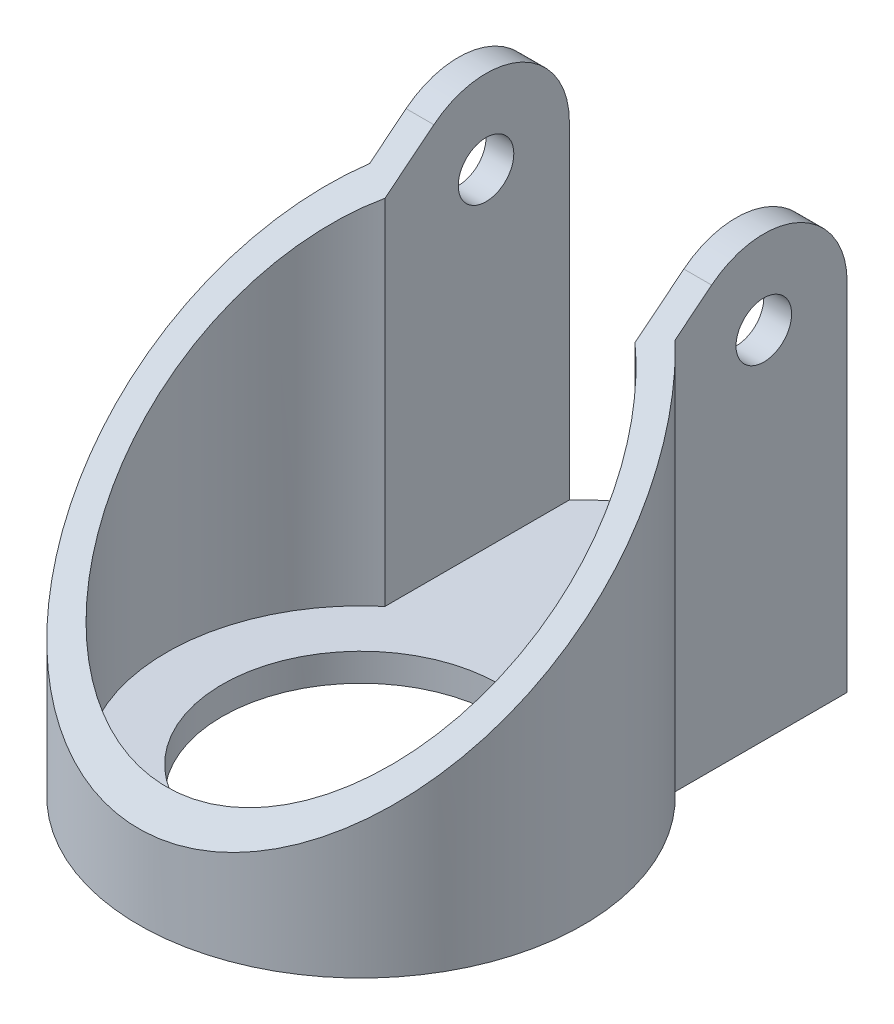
from build123d import *

# Parameters (mm, degrees)
ESQUISSE1_R             = 25
EXTRUSION1_DEPTH        = 100
ESQUISSE2_OUTSIDE_W     = 145.764
ESQUISSE2_OUTSIDE_H     = 135.764
ESQUISSE2_OUTSIDE_R     = 5
ENL_V_MAT_EXTRU_2_DEPTH = 50
ENL_V_MAT_EXTRU_3_DEPTH = 100


with BuildPart() as part:
    # Esquisse1 → Extrusion1 (new body)
    with BuildSketch(Plane(origin=(0, 0, 0), x_dir=(1, 0, 0), z_dir=(0, 1, 0))):
        with BuildLine():
            Line((-27.5, 29.047375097), (-27.5, 60))
            Line((-27.5, 60), (-22.5, 60))
            ThreePointArc((-22.5, 60), (0, 70), (22.5, 60))
            Line((22.5, 60), (27.5, 60))
            Line((27.5, 60), (27.5, 29.047375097))
            ThreePointArc((27.5, 29.047375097), (0, -40), (-27.5, 29.047375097))
        make_face()
        with Locations(Location((0, 0, 0), (0, 0, 270))):
            Circle(ESQUISSE1_R, mode=Mode.SUBTRACT)
    extrude(amount=EXTRUSION1_DEPTH)

    # Esquisse2 outside → Enl_v. mat.-Extru.2 (cut, symmetric)
    # profile 1 of 2: a face of its own
    with BuildSketch(Plane(origin=(0, 0, 0), x_dir=(0, 0, -1), z_dir=(1, 0, 0))):
        with Locations((15, 50)):
            Rectangle(ESQUISSE2_OUTSIDE_W, ESQUISSE2_OUTSIDE_H)
        with BuildLine():
            Line((-40, 15), (35.609839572, 75.697217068))
            ThreePointArc((35.609839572, 75.697217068), (51.486431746, 77.525021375), (60, 64))
            Line((60, 64), (60, 5))
            Line((60, 5), (70, 5))
            Line((70, 5), (70, 0))
            Line((70, 0), (-40, 0))
            Line((-40, 0), (-40, 15))
        make_face(mode=Mode.SUBTRACT)
    # profile 2 of 2: a face of its own
    with BuildSketch(Plane(origin=(0, 0, 0), x_dir=(0, 0, -1), z_dir=(1, 0, 0))):
        with Locations((45, 64)):
            Circle(ESQUISSE2_OUTSIDE_R)
    extrude(amount=ENL_V_MAT_EXTRU_2_DEPTH, both=True, mode=Mode.SUBTRACT)

    # Esquisse3 → Enl_v. mat.-Extru.3 (cut)
    with BuildSketch(Plane.XZ.offset(-5)):
        with BuildLine():
            Line((-22.5, -65), (-22.5, -26.809513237))
            ThreePointArc((-22.5, -26.809513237), (0, 35), (22.5, -26.809513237))
            Line((22.5, -26.809513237), (22.5, -65))
            Line((22.5, -65), (-22.5, -65))
        make_face()
    extrude(amount=-ENL_V_MAT_EXTRU_3_DEPTH, mode=Mode.SUBTRACT)


solid = part.part
